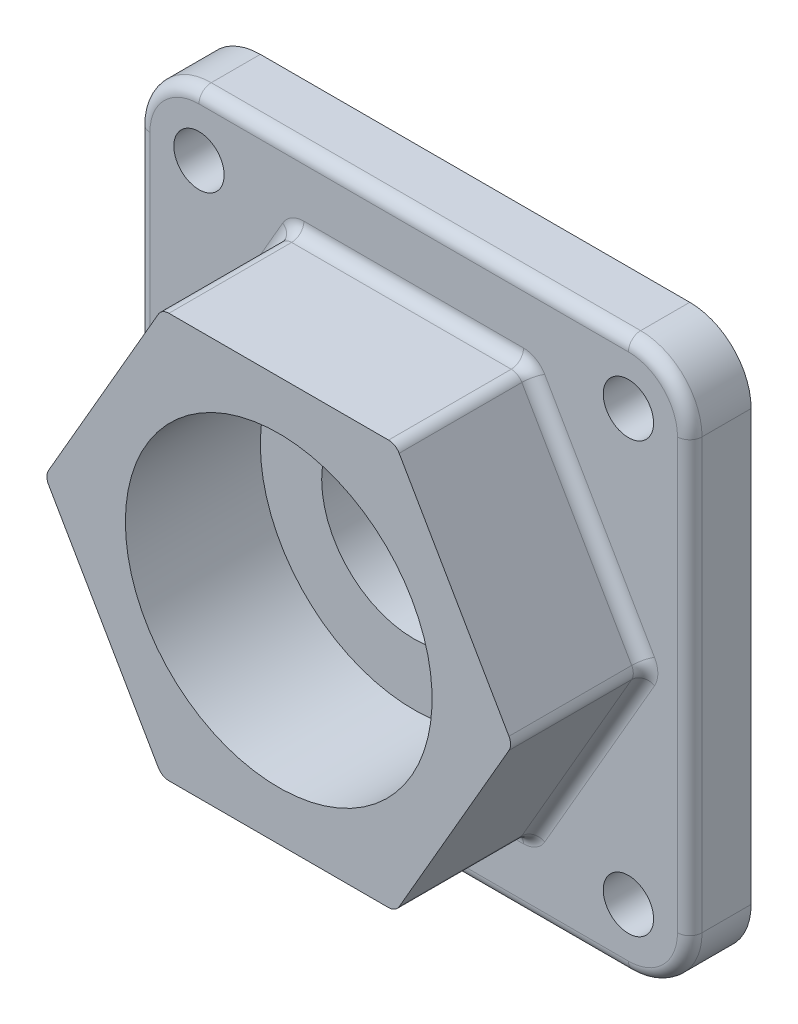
from build123d import *

# Parameters (mm, degrees)
BOSS_EXTRUDE1_DEPTH        = 5
BOSS_EXTRUDE2_DEPTH        = 22
SKETCH3_R                  = 32.5
BOSS_EXTRUDE3_DEPTH        = 2.5
SKETCH4_R                  = 27.5
BOSS_EXTRUDE4_DEPTH        = 13
FILLET1_R                  = 2
F_8_2_8_2_DIAMETER_HOLE1_D = 8.2


with BuildPart() as part:
    # Sketch1 → Boss-Extrude1 (new, symmetric)
    with BuildSketch(Plane.XY):
        with BuildLine():
            Line((-35, 45), (35, 45))
            ThreePointArc((35, 45), (42.071067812, 42.071067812), (45, 35))
            Line((45, 35), (45, -35))
            ThreePointArc((45, -35), (42.071067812, -42.071067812), (35, -45))
            Line((35, -45), (-35, -45))
            ThreePointArc((-35, -45), (-42.071067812, -42.071067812), (-45, -35))
            Line((-45, -35), (-45, 35))
            ThreePointArc((-45, 35), (-42.071067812, 42.071067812), (-35, 45))
        make_face()
    extrude(amount=BOSS_EXTRUDE1_DEPTH, both=True)

    # Sketch2 → Boss-Extrude2 (add)
    with BuildSketch(Plane.XY.offset(5)):
        Polygon((19.052558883, -33), (38.105117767, 0), (19.052558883, 33), (-19.052558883, 33), (-38.105117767, 0), (-19.052558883, -33), align=None)
    extrude(amount=BOSS_EXTRUDE2_DEPTH)

    # Sketch3 → Boss-Extrude3 (add)
    with BuildSketch(Plane(origin=(0, 0, -5), x_dir=(-1, 0, 0), z_dir=(0, 0, -1))):
        with Locations(Location((0, 0, 0), (0, 0, 180))):
            Circle(SKETCH3_R)
    extrude(amount=BOSS_EXTRUDE3_DEPTH)

    # Sketch4 → Boss-Extrude4 (add)
    with BuildSketch(Plane(origin=(0, 0, -7.5), x_dir=(-1, 0, 0), z_dir=(0, 0, -1))):
        with Locations(Location((0, 0, 0), (0, 0, 180))):
            Circle(SKETCH4_R)
    extrude(amount=BOSS_EXTRUDE4_DEPTH)

    # Sketch5 → Cut-Revolve1 (revolve, cut)
    with BuildSketch(Plane(origin=(0, 0, 0), x_dir=(1, 0, 0), z_dir=(0, 1, 0))):
        with BuildLine():
            Line((-25, -27), (-25, -5))
            Line((-25, -5), (-15, -5))
            Line((-15, -5), (-15, 14))
            ThreePointArc((-15, 14), (-19.184417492, 16.916641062), (-22.814249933, 20.5))
            Line((-22.814249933, 20.5), (0, 20.5))
            Line((0, 20.5), (0, -27))
            Line((0, -27), (-25, -27))
        make_face()
    revolve(axis=Axis((0, 0, -39.265933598), (0, 0, 1)), mode=Mode.SUBTRACT)

    # Fillet1
    fillet1_edges = [part.edges().sort_by_distance(p)[0] for p in [
        (42.071067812, 42.071067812, 5),
        (0, 45, 5),
        (-42.071067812, 42.071067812, 5),
        (-45, 0, 5),
        (-42.071067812, -42.071067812, 5),
        (0, -45, 5),
        (0, -33, 5),
        (-19.052558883, -33, 16),
        (28.578838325, -16.5, 5),
        (19.052558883, -33, 16),
        (28.578838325, 16.5, 5),
        (38.105117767, 0, 16),
        (0, 33, 5),
        (19.052558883, 33, 16),
        (-28.578838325, 16.5, 5),
        (-19.052558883, 33, 16),
        (-28.578838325, -16.5, 5),
        (-38.105117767, 0, 16),
        (42.071067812, -42.071067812, 5),
        (45, 0, 5),
    ]]
    fillet(fillet1_edges, radius=FILLET1_R)

    # 8.2 _8.2_ Diameter Hole1 (through all)
    with Locations(Plane.XY.offset(5)):
        with Locations((-35, 35), (35, 35), (35, -35), (-35, -35)):
            Hole(F_8_2_8_2_DIAMETER_HOLE1_D / 2)


solid = part.part
